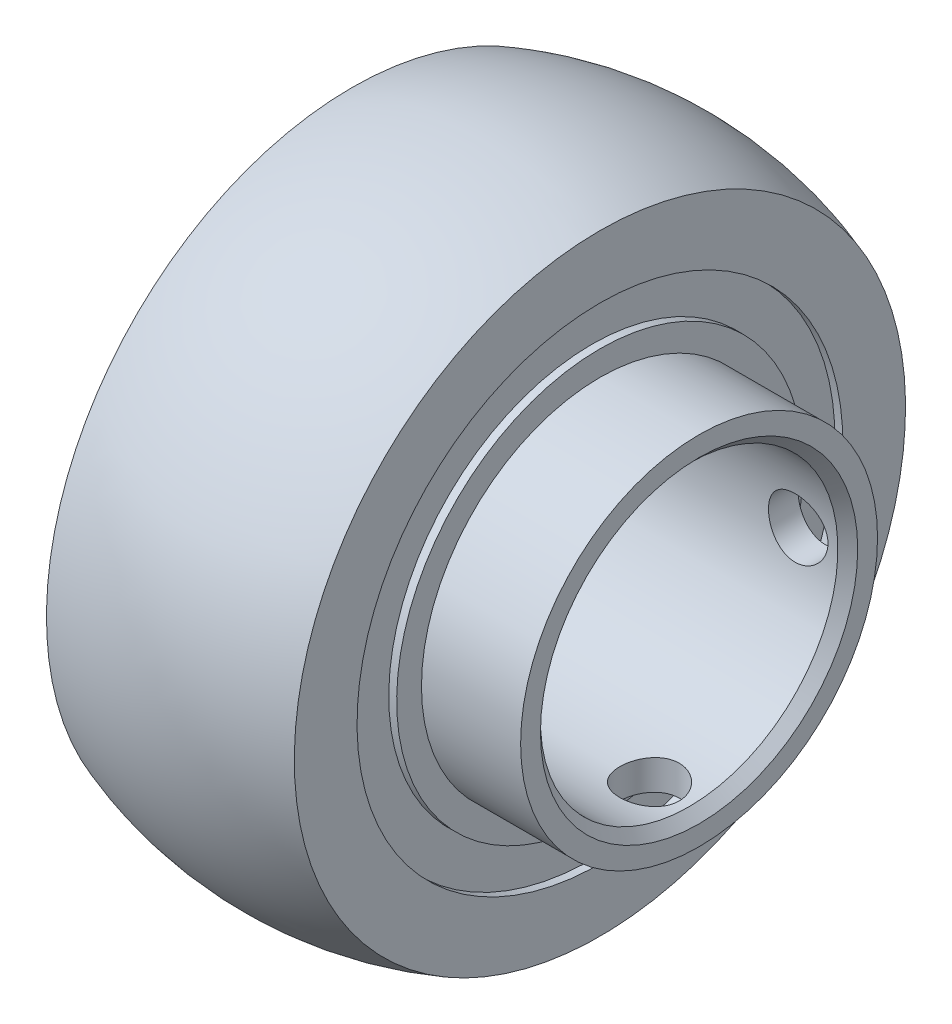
ISO-10303-21;
HEADER;
FILE_DESCRIPTION(('STEP AP214'),'2;1');
FILE_NAME('part.step','',(''),(''),'','','');
FILE_SCHEMA(('AUTOMOTIVE_DESIGN { 1 0 10303 214 1 1 1 1 }'));
ENDSEC;
DATA;
#1=APPLICATION_CONTEXT('core data for automotive mechanical design processes');
#2=APPLICATION_PROTOCOL_DEFINITION('international standard','automotive_design',2000,#1);
#3=PRODUCT_CONTEXT('',#1,'mechanical');
#4=PRODUCT('Part','Part','',(#3));
#5=PRODUCT_RELATED_PRODUCT_CATEGORY('part','',(#4));
#6=PRODUCT_DEFINITION_FORMATION('','',#4);
#7=PRODUCT_DEFINITION_CONTEXT('part definition',#1,'design');
#8=PRODUCT_DEFINITION('design','',#6,#7);
#9=PRODUCT_DEFINITION_SHAPE('','',#8);
#10=(LENGTH_UNIT() NAMED_UNIT(*) SI_UNIT(.MILLI.,.METRE.));
#11=(NAMED_UNIT(*) PLANE_ANGLE_UNIT() SI_UNIT($,.RADIAN.));
#12=(NAMED_UNIT(*) SI_UNIT($,.STERADIAN.) SOLID_ANGLE_UNIT());
#13=UNCERTAINTY_MEASURE_WITH_UNIT(LENGTH_MEASURE(1.E-05),#10,'distance_accuracy_value','');
#14=(GEOMETRIC_REPRESENTATION_CONTEXT(3) GLOBAL_UNCERTAINTY_ASSIGNED_CONTEXT((#13)) GLOBAL_UNIT_ASSIGNED_CONTEXT((#10,
#11,#12)) REPRESENTATION_CONTEXT('',''));
#15=CARTESIAN_POINT('',(0.,0.,0.));
#16=DIRECTION('',(0.,0.,1.));
#17=DIRECTION('',(1.,0.,0.));
#18=AXIS2_PLACEMENT_3D('',#15,#16,#17);
#19=CARTESIAN_POINT('',(13.,0.,0.));
#20=DIRECTION('',(1.,0.,0.));
#21=DIRECTION('',(0.,1.,0.));
#22=AXIS2_PLACEMENT_3D('',#19,#20,#21);
#23=CYLINDRICAL_SURFACE('',#22,18.);
#24=CARTESIAN_POINT('',(-17.5,0.,0.));
#25=DIRECTION('',(1.,0.,0.));
#26=DIRECTION('',(0.,1.,0.));
#27=AXIS2_PLACEMENT_3D('',#24,#25,#26);
#28=CIRCLE('',#27,18.);
#29=CARTESIAN_POINT('',(-17.5,18.,0.));
#30=VERTEX_POINT('',#29);
#31=EDGE_CURVE('E10',#30,#30,#28,.T.);
#32=ORIENTED_EDGE('',*,*,#31,.T.);
#33=EDGE_LOOP('',(#32));
#34=FACE_BOUND('',#33,.T.);
#35=CARTESIAN_POINT('',(-12.5,0.,0.));
#36=DIRECTION('',(1.,0.,0.));
#37=DIRECTION('',(0.,1.,0.));
#38=AXIS2_PLACEMENT_3D('',#35,#36,#37);
#39=CIRCLE('',#38,18.);
#40=CARTESIAN_POINT('',(-12.5,18.,0.));
#41=VERTEX_POINT('',#40);
#42=EDGE_CURVE('E78',#41,#41,#39,.T.);
#43=ORIENTED_EDGE('',*,*,#42,.F.);
#44=EDGE_LOOP('',(#43));
#45=FACE_BOUND('',#44,.T.);
#46=ADVANCED_FACE('F31',(#34,#45),#23,.T.);
#47=CARTESIAN_POINT('',(-17.5,18.,0.));
#48=DIRECTION('',(-1.,0.,0.));
#49=DIRECTION('',(0.,-1.,0.));
#50=AXIS2_PLACEMENT_3D('',#47,#48,#49);
#51=PLANE('',#50);
#52=CARTESIAN_POINT('',(-17.5,0.,0.));
#53=DIRECTION('',(1.,0.,0.));
#54=DIRECTION('',(0.,1.,0.));
#55=AXIS2_PLACEMENT_3D('',#52,#53,#54);
#56=CIRCLE('',#55,16.);
#57=CARTESIAN_POINT('',(-17.5,16.,0.));
#58=VERTEX_POINT('',#57);
#59=EDGE_CURVE('E42',#58,#58,#56,.T.);
#60=ORIENTED_EDGE('',*,*,#59,.T.);
#61=EDGE_LOOP('',(#60));
#62=FACE_BOUND('',#61,.T.);
#63=ORIENTED_EDGE('',*,*,#31,.F.);
#64=EDGE_LOOP('',(#63));
#65=FACE_BOUND('',#64,.T.);
#66=ADVANCED_FACE('F92',(#62,#65),#51,.T.);
#67=CARTESIAN_POINT('',(-17.5,0.,0.));
#68=DIRECTION('',(-1.,0.,0.));
#69=DIRECTION('',(0.,-1.,0.));
#70=AXIS2_PLACEMENT_3D('',#67,#68,#69);
#71=CONICAL_SURFACE('',#70,16.,0.785398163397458);
#72=CARTESIAN_POINT('',(-16.5,0.,0.));
#73=DIRECTION('',(1.,0.,0.));
#74=DIRECTION('',(0.,1.,0.));
#75=AXIS2_PLACEMENT_3D('',#72,#73,#74);
#76=CIRCLE('',#75,15.);
#77=CARTESIAN_POINT('',(-16.5,15.,0.));
#78=VERTEX_POINT('',#77);
#79=EDGE_CURVE('E47',#78,#78,#76,.T.);
#80=ORIENTED_EDGE('',*,*,#79,.T.);
#81=EDGE_LOOP('',(#80));
#82=FACE_BOUND('',#81,.T.);
#83=ORIENTED_EDGE('',*,*,#59,.F.);
#84=EDGE_LOOP('',(#83));
#85=FACE_BOUND('',#84,.T.);
#86=ADVANCED_FACE('F88',(#82,#85),#71,.F.);
#87=CARTESIAN_POINT('',(13.,0.,0.));
#88=DIRECTION('',(1.,0.,0.));
#89=DIRECTION('',(0.,1.,0.));
#90=AXIS2_PLACEMENT_3D('',#87,#88,#89);
#91=CYLINDRICAL_SURFACE('',#90,15.);
#92=CARTESIAN_POINT('',(17.5,-14.6969384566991,3.));
#93=CARTESIAN_POINT('',(17.6666931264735,-14.6969417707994,2.99999383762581));
#94=CARTESIAN_POINT('',(17.83346387,-14.6998052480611,2.98605951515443));
#95=CARTESIAN_POINT('',(18.1622875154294,-14.7109329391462,2.93073685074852));
#96=CARTESIAN_POINT('',(18.324336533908,-14.7192014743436,2.88932654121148));
#97=CARTESIAN_POINT('',(18.6389119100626,-14.7401662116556,2.78038734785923));
#98=CARTESIAN_POINT('',(18.7914475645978,-14.7528580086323,2.71288444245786));
#99=CARTESIAN_POINT('',(19.0830245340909,-14.7812339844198,2.55374732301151));
#100=CARTESIAN_POINT('',(19.2220666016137,-14.7969179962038,2.46211445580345));
#101=CARTESIAN_POINT('',(19.4846830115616,-14.8297589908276,2.2559372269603));
#102=CARTESIAN_POINT('',(19.6080387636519,-14.8469321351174,2.14111696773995));
#103=CARTESIAN_POINT('',(19.833872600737,-14.880674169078,1.89242036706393));
#104=CARTESIAN_POINT('',(19.9363492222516,-14.8972430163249,1.75854269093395));
#105=CARTESIAN_POINT('',(20.1183640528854,-14.9280838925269,1.47408406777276));
#106=CARTESIAN_POINT('',(20.1976945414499,-14.9423346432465,1.32336770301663));
#107=CARTESIAN_POINT('',(20.3298248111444,-14.9667521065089,1.01041245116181));
#108=CARTESIAN_POINT('',(20.382627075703,-14.9769192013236,0.848174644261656));
#109=CARTESIAN_POINT('',(20.4595215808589,-14.9919096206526,0.519050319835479));
#110=CARTESIAN_POINT('',(20.483982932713,-14.9968015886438,0.352253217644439));
#111=CARTESIAN_POINT('',(20.504652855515,-15.0009276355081,0.0168557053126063));
#112=CARTESIAN_POINT('',(20.5008641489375,-15.0001622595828,-0.151744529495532));
#113=CARTESIAN_POINT('',(20.4654214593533,-14.9931130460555,-0.483426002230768));
#114=CARTESIAN_POINT('',(20.4341650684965,-14.9869079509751,-0.646551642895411));
#115=CARTESIAN_POINT('',(20.3453049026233,-14.9697653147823,-0.965194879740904));
#116=CARTESIAN_POINT('',(20.2877000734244,-14.9588275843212,-1.12071217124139));
#117=CARTESIAN_POINT('',(20.1474098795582,-14.9333188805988,-1.42085838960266));
#118=CARTESIAN_POINT('',(20.0645687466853,-14.9187254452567,-1.5654125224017));
#119=CARTESIAN_POINT('',(19.8762727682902,-14.8875140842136,-1.83871513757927));
#120=CARTESIAN_POINT('',(19.7708153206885,-14.8708959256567,-1.967461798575));
#121=CARTESIAN_POINT('',(19.5380991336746,-14.8371289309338,-2.20785429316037));
#122=CARTESIAN_POINT('',(19.4104924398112,-14.8199758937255,-2.31916294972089));
#123=CARTESIAN_POINT('',(19.1382506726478,-14.7873471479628,-2.51885547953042));
#124=CARTESIAN_POINT('',(18.9936152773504,-14.7718714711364,-2.60723891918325));
#125=CARTESIAN_POINT('',(18.6909375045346,-14.7443414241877,-2.75868844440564));
#126=CARTESIAN_POINT('',(18.532867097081,-14.7322944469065,-2.82169994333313));
#127=CARTESIAN_POINT('',(18.208086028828,-14.7130942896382,-2.92017102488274));
#128=CARTESIAN_POINT('',(18.0413764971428,-14.7059404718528,-2.95563419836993));
#129=CARTESIAN_POINT('',(17.7071054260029,-14.6974643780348,-2.99749801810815));
#130=CARTESIAN_POINT('',(17.539607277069,-14.6960444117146,-3.00438557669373));
#131=CARTESIAN_POINT('',(17.205855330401,-14.6989345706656,-2.99021288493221));
#132=CARTESIAN_POINT('',(17.0396014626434,-14.7032443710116,-2.96915421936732));
#133=CARTESIAN_POINT('',(16.7146940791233,-14.7170169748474,-2.90010662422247));
#134=CARTESIAN_POINT('',(16.5559829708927,-14.7264299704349,-2.85237786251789));
#135=CARTESIAN_POINT('',(16.2488101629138,-14.7493046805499,-2.73162310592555));
#136=CARTESIAN_POINT('',(16.1003493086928,-14.7627667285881,-2.65859502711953));
#137=CARTESIAN_POINT('',(15.8157606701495,-14.7924421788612,-2.48821242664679));
#138=CARTESIAN_POINT('',(15.6798188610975,-14.8086891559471,-2.39055323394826));
#139=CARTESIAN_POINT('',(15.4260750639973,-14.8420117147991,-2.17408671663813));
#140=CARTESIAN_POINT('',(15.3082749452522,-14.8590873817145,-2.05527721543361));
#141=CARTESIAN_POINT('',(15.0923123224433,-14.8924603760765,-1.79769682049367));
#142=CARTESIAN_POINT('',(14.99447903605,-14.9087417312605,-1.65864749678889));
#143=CARTESIAN_POINT('',(14.8235623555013,-14.9384138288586,-1.36580368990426));
#144=CARTESIAN_POINT('',(14.7504779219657,-14.9518046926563,-1.21200982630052));
#145=CARTESIAN_POINT('',(14.6316133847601,-14.974118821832,-0.894908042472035));
#146=CARTESIAN_POINT('',(14.5856784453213,-14.9830673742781,-0.731660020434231));
#147=CARTESIAN_POINT('',(14.5219262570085,-14.9955970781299,-0.399568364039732));
#148=CARTESIAN_POINT('',(14.504105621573,-14.9991788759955,-0.230725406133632));
#149=CARTESIAN_POINT('',(14.4972190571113,-15.0005562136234,0.104618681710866));
#150=CARTESIAN_POINT('',(14.5076581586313,-14.9984513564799,0.271109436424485));
#151=CARTESIAN_POINT('',(14.5559018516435,-14.9889013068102,0.599913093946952));
#152=CARTESIAN_POINT('',(14.5937060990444,-14.9814561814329,0.762226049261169));
#153=CARTESIAN_POINT('',(14.6953869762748,-14.9620649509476,1.0777582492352));
#154=CARTESIAN_POINT('',(14.7592041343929,-14.9501291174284,1.23099732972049));
#155=CARTESIAN_POINT('',(14.9110367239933,-14.9230416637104,1.52466366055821));
#156=CARTESIAN_POINT('',(14.9990540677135,-14.9078897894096,1.66508989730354));
#157=CARTESIAN_POINT('',(15.1984581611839,-14.8757279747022,1.93159167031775));
#158=CARTESIAN_POINT('',(15.3101990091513,-14.858692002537,2.05739914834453));
#159=CARTESIAN_POINT('',(15.5531507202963,-14.8248366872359,2.28864785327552));
#160=CARTESIAN_POINT('',(15.6843661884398,-14.8080173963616,2.39408424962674));
#161=CARTESIAN_POINT('',(15.9642379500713,-14.7763002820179,2.58267665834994));
#162=CARTESIAN_POINT('',(16.1130668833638,-14.7614251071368,2.66558044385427));
#163=CARTESIAN_POINT('',(16.4227983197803,-14.7355571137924,2.80507214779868));
#164=CARTESIAN_POINT('',(16.5836897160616,-14.7245607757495,2.86168393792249));
#165=CARTESIAN_POINT('',(16.8707873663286,-14.7098904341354,2.93600741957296));
#166=CARTESIAN_POINT('',(16.9953562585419,-14.7050635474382,2.95996169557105));
#167=CARTESIAN_POINT('',(17.2466018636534,-14.6985863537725,2.99196005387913));
#168=CARTESIAN_POINT('',(17.3732785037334,-14.6969359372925,3.00000468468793));
#169=CARTESIAN_POINT('',(17.5,-14.6969384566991,3.));
#170=B_SPLINE_CURVE_WITH_KNOTS('',3,(#92,#93,#94,#95,#96,#97,#98,#99,#100,#101,#102,#103,#104,
#105,#106,#107,#108,#109,#110,#111,#112,#113,#114,#115,#116,#117,#118,#119,#120,#121,#122,#123,
#124,#125,#126,#127,#128,#129,#130,#131,#132,#133,#134,#135,#136,#137,#138,#139,#140,#141,#142,
#143,#144,#145,#146,#147,#148,#149,#150,#151,#152,#153,#154,#155,#156,#157,#158,#159,#160,#161,
#162,#163,#164,#165,#166,#167,#168,#169),.UNSPECIFIED.,.T.,.F.,(4,2,2,2,2,2,2,2,2,2,2,2,2,2,2,2,
2,2,2,2,2,2,2,2,2,2,2,2,2,2,2,2,2,2,2,2,2,2,4),(0.,0.499615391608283,0.999630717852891,
1.49914949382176,1.9986403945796,2.5044675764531,3.01033020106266,3.52060201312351,
4.03082604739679,4.53432746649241,5.03778036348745,5.53406368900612,6.0303668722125,
6.52979772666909,7.02928607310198,7.53748040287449,8.04568434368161,8.5549758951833,
9.06420105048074,9.5647127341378,10.0651960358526,10.5608802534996,11.0566053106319,
11.5587917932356,12.0610299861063,12.5709780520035,13.0809046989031,13.5878944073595,
14.0948230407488,14.5929305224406,15.0910317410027,15.5880005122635,16.0850085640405,
16.5900345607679,17.0951801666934,17.6057669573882,18.1158892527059,18.4957141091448,
18.8755258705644),.UNSPECIFIED.);
#171=CARTESIAN_POINT('',(17.5,-14.6969384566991,3.));
#172=VERTEX_POINT('',#171);
#173=EDGE_CURVE('E56',#172,#172,#170,.T.);
#174=ORIENTED_EDGE('',*,*,#173,.F.);
#175=EDGE_LOOP('',(#174));
#176=FACE_BOUND('',#175,.T.);
#177=CARTESIAN_POINT('',(20.5,0.,-15.));
#178=CARTESIAN_POINT('',(20.499993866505,0.1667307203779,-14.9999969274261));
#179=CARTESIAN_POINT('',(20.4860534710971,0.333538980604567,-14.9971915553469));
#180=CARTESIAN_POINT('',(20.4307044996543,0.662440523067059,-14.9862709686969));
#181=CARTESIAN_POINT('',(20.3892741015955,0.824529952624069,-14.9781515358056));
#182=CARTESIAN_POINT('',(20.2802761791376,1.13919091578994,-14.9575094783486));
#183=CARTESIAN_POINT('',(20.212733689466,1.29177140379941,-14.9449910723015));
#184=CARTESIAN_POINT('',(20.0535032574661,1.58342396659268,-14.9169119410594));
#185=CARTESIAN_POINT('',(19.9618167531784,1.72249684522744,-14.9013513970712));
#186=CARTESIAN_POINT('',(19.7555845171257,1.9850804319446,-14.8686649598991));
#187=CARTESIAN_POINT('',(19.6407749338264,2.10838185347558,-14.8515223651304));
#188=CARTESIAN_POINT('',(19.3921227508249,2.33411026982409,-14.8177254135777));
#189=CARTESIAN_POINT('',(19.2582786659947,2.43653563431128,-14.8010710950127));
#190=CARTESIAN_POINT('',(18.9738514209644,2.61849526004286,-14.7699732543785));
#191=CARTESIAN_POINT('',(18.8231270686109,2.6978128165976,-14.7555512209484));
#192=CARTESIAN_POINT('',(18.5101545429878,2.82991699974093,-14.7307880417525));
#193=CARTESIAN_POINT('',(18.347907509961,2.88270624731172,-14.7204464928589));
#194=CARTESIAN_POINT('',(18.0187469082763,2.95957589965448,-14.7051841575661));
#195=CARTESIAN_POINT('',(17.8519223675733,2.98402349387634,-14.7001941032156));
#196=CARTESIAN_POINT('',(17.516470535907,3.00465638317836,-14.6959912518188));
#197=CARTESIAN_POINT('',(17.3478434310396,3.0008445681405,-14.6967778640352));
#198=CARTESIAN_POINT('',(17.016259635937,2.96536371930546,-14.7039765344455));
#199=CARTESIAN_POINT('',(16.8532557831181,2.93411562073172,-14.7103035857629));
#200=CARTESIAN_POINT('',(16.534851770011,2.84531365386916,-14.7277363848));
#201=CARTESIAN_POINT('',(16.379451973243,2.78775852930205,-14.7388423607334));
#202=CARTESIAN_POINT('',(16.0794542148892,2.64757435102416,-14.7646685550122));
#203=CARTESIAN_POINT('',(15.9349363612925,2.56477845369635,-14.7794126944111));
#204=CARTESIAN_POINT('',(15.6616874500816,2.37658072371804,-14.8108385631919));
#205=CARTESIAN_POINT('',(15.5329582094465,2.27117629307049,-14.827520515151));
#206=CARTESIAN_POINT('',(15.2925117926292,2.03849980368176,-14.8613106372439));
#207=CARTESIAN_POINT('',(15.1811422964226,1.91086848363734,-14.8784210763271));
#208=CARTESIAN_POINT('',(14.9813384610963,1.63855507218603,-14.9108654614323));
#209=CARTESIAN_POINT('',(14.8929044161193,1.49387276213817,-14.9261993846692));
#210=CARTESIAN_POINT('',(14.7414174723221,1.19117816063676,-14.9534007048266));
#211=CARTESIAN_POINT('',(14.6784043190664,1.0331454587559,-14.9652626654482));
#212=CARTESIAN_POINT('',(14.5799185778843,0.708446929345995,-14.9841422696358));
#213=CARTESIAN_POINT('',(14.5444426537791,0.541782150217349,-14.9911605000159));
#214=CARTESIAN_POINT('',(14.5025306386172,0.207538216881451,-14.999480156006));
#215=CARTESIAN_POINT('',(14.4956187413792,0.0400209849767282,-15.0008752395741));
#216=CARTESIAN_POINT('',(14.5097495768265,-0.293774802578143,-14.9980515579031));
#217=CARTESIAN_POINT('',(14.5307907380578,-0.460053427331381,-14.9938331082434));
#218=CARTESIAN_POINT('',(14.5998351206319,-0.785116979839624,-14.9803149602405));
#219=CARTESIAN_POINT('',(14.6475942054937,-0.943955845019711,-14.9710612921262));
#220=CARTESIAN_POINT('',(14.7684519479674,-1.251370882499,-14.948506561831));
#221=CARTESIAN_POINT('',(14.8415525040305,-1.39994628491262,-14.9352051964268));
#222=CARTESIAN_POINT('',(15.0120474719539,-1.68462352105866,-14.9057973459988));
#223=CARTESIAN_POINT('',(15.1097283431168,-1.82055038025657,-14.8896585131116));
#224=CARTESIAN_POINT('',(15.3262275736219,-2.07425405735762,-14.8564420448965));
#225=CARTESIAN_POINT('',(15.4450481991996,-2.19202892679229,-14.8393643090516));
#226=CARTESIAN_POINT('',(15.7026200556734,-2.40792177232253,-14.805879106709));
#227=CARTESIAN_POINT('',(15.841647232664,-2.50571310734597,-14.7894858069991));
#228=CARTESIAN_POINT('',(16.13443408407,-2.67655626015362,-14.7595257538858));
#229=CARTESIAN_POINT('',(16.2881931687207,-2.74960906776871,-14.7459588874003));
#230=CARTESIAN_POINT('',(16.6053047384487,-2.86845552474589,-14.7233022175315));
#231=CARTESIAN_POINT('',(16.768602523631,-2.91439049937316,-14.7141892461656));
#232=CARTESIAN_POINT('',(17.1008003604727,-2.97812595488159,-14.7014231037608));
#233=CARTESIAN_POINT('',(17.2696996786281,-2.99593010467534,-14.6977692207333));
#234=CARTESIAN_POINT('',(17.605026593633,-3.00276273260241,-14.6963744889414));
#235=CARTESIAN_POINT('',(17.771443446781,-2.99230736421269,-14.698527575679));
#236=CARTESIAN_POINT('',(18.1000949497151,-2.94405691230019,-14.7082672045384));
#237=CARTESIAN_POINT('',(18.2623296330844,-2.9062620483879,-14.7158537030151));
#238=CARTESIAN_POINT('',(18.5776831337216,-2.80463570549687,-14.7355579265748));
#239=CARTESIAN_POINT('',(18.7308230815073,-2.74086752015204,-14.7476646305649));
#240=CARTESIAN_POINT('',(19.0243111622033,-2.58916393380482,-14.7750514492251));
#241=CARTESIAN_POINT('',(19.1646582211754,-2.50122650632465,-14.7903318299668));
#242=CARTESIAN_POINT('',(19.431146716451,-2.30191774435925,-14.8226688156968));
#243=CARTESIAN_POINT('',(19.5570062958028,-2.19017366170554,-14.839751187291));
#244=CARTESIAN_POINT('',(19.7883586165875,-1.94719310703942,-14.8735824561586));
#245=CARTESIAN_POINT('',(19.8938466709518,-1.81595216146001,-14.8903312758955));
#246=CARTESIAN_POINT('',(20.0825039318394,-1.53605288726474,-14.9218149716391));
#247=CARTESIAN_POINT('',(20.1654280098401,-1.38722665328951,-14.9365269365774));
#248=CARTESIAN_POINT('',(20.3049583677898,-1.0774990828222,-14.96205375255));
#249=CARTESIAN_POINT('',(20.3615883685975,-0.91660878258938,-14.9728721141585));
#250=CARTESIAN_POINT('',(20.4359558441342,-0.629464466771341,-14.9872911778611));
#251=CARTESIAN_POINT('',(20.4599295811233,-0.504844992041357,-14.9920290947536));
#252=CARTESIAN_POINT('',(20.4919537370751,-0.253498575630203,-14.9983846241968));
#253=CARTESIAN_POINT('',(20.5000046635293,-0.126771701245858,-15.0000023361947));
#254=CARTESIAN_POINT('',(20.5,0.,-15.));
#255=B_SPLINE_CURVE_WITH_KNOTS('',3,(#177,#178,#179,#180,#181,#182,#183,#184,#185,#186,#187,
#188,#189,#190,#191,#192,#193,#194,#195,#196,#197,#198,#199,#200,#201,#202,#203,#204,#205,#206,
#207,#208,#209,#210,#211,#212,#213,#214,#215,#216,#217,#218,#219,#220,#221,#222,#223,#224,#225,
#226,#227,#228,#229,#230,#231,#232,#233,#234,#235,#236,#237,#238,#239,#240,#241,#242,#243,#244,
#245,#246,#247,#248,#249,#250,#251,#252,#253,#254),.UNSPECIFIED.,.T.,.F.,(4,2,2,2,2,2,2,2,2,2,2,
2,2,2,2,2,2,2,2,2,2,2,2,2,2,2,2,2,2,2,2,2,2,2,2,2,2,2,4),(0.,0.499728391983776,
0.999853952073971,1.49950120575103,1.99911870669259,2.50479801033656,3.0105167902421,
3.52083585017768,4.03110448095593,4.53468555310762,5.03821512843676,5.53415181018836,
6.0301121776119,6.52942470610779,7.02879464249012,7.53714757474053,8.04550702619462,
8.55465824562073,9.06374777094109,9.56432207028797,10.064868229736,10.5609136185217,
11.0569961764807,11.5591519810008,12.0613616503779,12.5712188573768,13.081055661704,
13.5882114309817,14.0953010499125,14.5931916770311,15.0910783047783,15.5877588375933,
16.084481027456,16.5896422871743,17.0949196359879,17.6054849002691,18.1155886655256,
18.4955632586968,18.8755257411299),.UNSPECIFIED.);
#256=CARTESIAN_POINT('',(20.5,0.,-15.));
#257=VERTEX_POINT('',#256);
#258=EDGE_CURVE('E55',#257,#257,#255,.T.);
#259=ORIENTED_EDGE('',*,*,#258,.F.);
#260=EDGE_LOOP('',(#259));
#261=FACE_BOUND('',#260,.T.);
#262=CARTESIAN_POINT('',(21.5,0.,0.));
#263=DIRECTION('',(1.,0.,0.));
#264=DIRECTION('',(0.,1.,0.));
#265=AXIS2_PLACEMENT_3D('',#262,#263,#264);
#266=CIRCLE('',#265,15.);
#267=CARTESIAN_POINT('',(21.5,15.,0.));
#268=VERTEX_POINT('',#267);
#269=EDGE_CURVE('E149',#268,#268,#266,.T.);
#270=ORIENTED_EDGE('',*,*,#269,.T.);
#271=EDGE_LOOP('',(#270));
#272=FACE_BOUND('',#271,.T.);
#273=ORIENTED_EDGE('',*,*,#79,.F.);
#274=EDGE_LOOP('',(#273));
#275=FACE_BOUND('',#274,.T.);
#276=ADVANCED_FACE('F82',(#176,#261,#272,#275),#91,.F.);
#277=CARTESIAN_POINT('',(21.5,0.,0.));
#278=DIRECTION('',(1.,0.,0.));
#279=DIRECTION('',(0.,1.,0.));
#280=AXIS2_PLACEMENT_3D('',#277,#278,#279);
#281=CONICAL_SURFACE('',#280,15.,0.785398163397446);
#282=CARTESIAN_POINT('',(22.5,0.,0.));
#283=DIRECTION('',(1.,0.,0.));
#284=DIRECTION('',(0.,1.,0.));
#285=AXIS2_PLACEMENT_3D('',#282,#283,#284);
#286=CIRCLE('',#285,16.);
#287=CARTESIAN_POINT('',(22.5,16.,0.));
#288=VERTEX_POINT('',#287);
#289=EDGE_CURVE('E146',#288,#288,#286,.T.);
#290=ORIENTED_EDGE('',*,*,#289,.T.);
#291=EDGE_LOOP('',(#290));
#292=FACE_BOUND('',#291,.T.);
#293=ORIENTED_EDGE('',*,*,#269,.F.);
#294=EDGE_LOOP('',(#293));
#295=FACE_BOUND('',#294,.T.);
#296=ADVANCED_FACE('F87',(#292,#295),#281,.F.);
#297=CARTESIAN_POINT('',(22.5,16.,0.));
#298=DIRECTION('',(1.,0.,0.));
#299=DIRECTION('',(0.,1.,0.));
#300=AXIS2_PLACEMENT_3D('',#297,#298,#299);
#301=PLANE('',#300);
#302=CARTESIAN_POINT('',(22.5,0.,0.));
#303=DIRECTION('',(1.,0.,0.));
#304=DIRECTION('',(0.,1.,0.));
#305=AXIS2_PLACEMENT_3D('',#302,#303,#304);
#306=CIRCLE('',#305,18.);
#307=CARTESIAN_POINT('',(22.5,18.,0.));
#308=VERTEX_POINT('',#307);
#309=EDGE_CURVE('E143',#308,#308,#306,.T.);
#310=ORIENTED_EDGE('',*,*,#309,.T.);
#311=EDGE_LOOP('',(#310));
#312=FACE_BOUND('',#311,.T.);
#313=ORIENTED_EDGE('',*,*,#289,.F.);
#314=EDGE_LOOP('',(#313));
#315=FACE_BOUND('',#314,.T.);
#316=ADVANCED_FACE('F158',(#312,#315),#301,.T.);
#317=CARTESIAN_POINT('',(13.,0.,0.));
#318=DIRECTION('',(1.,0.,0.));
#319=DIRECTION('',(0.,1.,0.));
#320=AXIS2_PLACEMENT_3D('',#317,#318,#319);
#321=CYLINDRICAL_SURFACE('',#320,18.);
#322=CARTESIAN_POINT('',(17.5,-17.7482393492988,3.));
#323=CARTESIAN_POINT('',(17.3327491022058,-17.7482423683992,2.99999327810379));
#324=CARTESIAN_POINT('',(17.1654068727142,-17.7506291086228,2.98596620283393));
#325=CARTESIAN_POINT('',(16.8354177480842,-17.7599094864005,2.93025291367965));
#326=CARTESIAN_POINT('',(16.6727753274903,-17.7668072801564,2.88854119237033));
#327=CARTESIAN_POINT('',(16.3570092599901,-17.7843073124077,2.77875545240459));
#328=CARTESIAN_POINT('',(16.2038777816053,-17.7949064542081,2.71070346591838));
#329=CARTESIAN_POINT('',(15.9112228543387,-17.8186112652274,2.55022379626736));
#330=CARTESIAN_POINT('',(15.7716978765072,-17.8317166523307,2.45779885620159));
#331=CARTESIAN_POINT('',(15.5088245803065,-17.8591016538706,2.25022503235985));
#332=CARTESIAN_POINT('',(15.3856298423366,-17.8733906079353,2.1348828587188));
#333=CARTESIAN_POINT('',(15.1602480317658,-17.901449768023,1.88516640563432));
#334=CARTESIAN_POINT('',(15.0580622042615,-17.9152199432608,1.75079099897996));
#335=CARTESIAN_POINT('',(14.8770225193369,-17.9407888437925,1.46582744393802));
#336=CARTESIAN_POINT('',(14.7983115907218,-17.9525753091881,1.31514729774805));
#337=CARTESIAN_POINT('',(14.6673747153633,-17.9727448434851,1.00247474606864));
#338=CARTESIAN_POINT('',(14.6151470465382,-17.9811281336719,0.840483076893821));
#339=CARTESIAN_POINT('',(14.5391289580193,-17.9934808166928,0.511372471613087));
#340=CARTESIAN_POINT('',(14.5150805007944,-17.9974902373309,0.344314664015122));
#341=CARTESIAN_POINT('',(14.4953010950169,-18.0007809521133,0.00849034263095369));
#342=CARTESIAN_POINT('',(14.4995682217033,-18.0000625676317,-0.160276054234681));
#343=CARTESIAN_POINT('',(14.5360976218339,-17.9940103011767,-0.492962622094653));
#344=CARTESIAN_POINT('',(14.568082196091,-17.9887222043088,-0.656914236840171));
#345=CARTESIAN_POINT('',(14.6587012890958,-17.9741757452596,-0.977090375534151));
#346=CARTESIAN_POINT('',(14.7173366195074,-17.9649172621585,-1.13331466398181));
#347=CARTESIAN_POINT('',(14.8598687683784,-17.9433923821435,-1.43442737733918));
#348=CARTESIAN_POINT('',(14.9438800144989,-17.9311124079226,-1.57926062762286));
#349=CARTESIAN_POINT('',(15.1346953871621,-17.904908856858,-1.85287863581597));
#350=CARTESIAN_POINT('',(15.241501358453,-17.8909851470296,-1.98166209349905));
#351=CARTESIAN_POINT('',(15.4764145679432,-17.8628432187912,-2.221165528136));
#352=CARTESIAN_POINT('',(15.6047645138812,-17.8486234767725,-2.33164740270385));
#353=CARTESIAN_POINT('',(15.878304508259,-17.8216555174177,-2.52954550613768));
#354=CARTESIAN_POINT('',(16.0234947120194,-17.8089073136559,-2.6169615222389));
#355=CARTESIAN_POINT('',(16.326869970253,-17.7863250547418,-2.76629332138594));
#356=CARTESIAN_POINT('',(16.4850693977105,-17.7764942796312,-2.82818043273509));
#357=CARTESIAN_POINT('',(16.8098188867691,-17.7609142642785,-2.92443584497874));
#358=CARTESIAN_POINT('',(16.9763682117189,-17.7551646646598,-2.95880656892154));
#359=CARTESIAN_POINT('',(17.3109593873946,-17.7484675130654,-2.99871826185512));
#360=CARTESIAN_POINT('',(17.4789596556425,-17.747463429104,-3.00459864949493));
#361=CARTESIAN_POINT('',(17.813544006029,-17.7502204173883,-2.98826724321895));
#362=CARTESIAN_POINT('',(17.9801281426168,-17.7539813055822,-2.96605653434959));
#363=CARTESIAN_POINT('',(18.306073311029,-17.7657922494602,-2.89446280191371));
#364=CARTESIAN_POINT('',(18.4654733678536,-17.7738150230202,-2.84525254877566));
#365=CARTESIAN_POINT('',(18.7737641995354,-17.793222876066,-2.72123782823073));
#366=CARTESIAN_POINT('',(18.9226543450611,-17.8046081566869,-2.64643182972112));
#367=CARTESIAN_POINT('',(19.2072095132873,-17.8295895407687,-2.47254800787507));
#368=CARTESIAN_POINT('',(19.3427398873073,-17.8432050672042,-2.37325267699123));
#369=CARTESIAN_POINT('',(19.595336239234,-17.8710560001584,-2.15350735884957));
#370=CARTESIAN_POINT('',(19.7124009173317,-17.885291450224,-2.03305588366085));
#371=CARTESIAN_POINT('',(19.9259822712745,-17.9129570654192,-1.77291368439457));
#372=CARTESIAN_POINT('',(20.0222725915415,-17.9263773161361,-1.63303590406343));
#373=CARTESIAN_POINT('',(20.1899863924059,-17.9507413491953,-1.33889213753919));
#374=CARTESIAN_POINT('',(20.2614106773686,-17.9616852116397,-1.18462661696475));
#375=CARTESIAN_POINT('',(20.3770127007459,-17.979820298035,-0.866758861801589));
#376=CARTESIAN_POINT('',(20.4213088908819,-17.9870278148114,-0.70320067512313));
#377=CARTESIAN_POINT('',(20.4817787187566,-17.9969469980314,-0.37083688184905));
#378=CARTESIAN_POINT('',(20.4979546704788,-17.9996590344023,-0.20203170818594));
#379=CARTESIAN_POINT('',(20.5016582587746,-18.0002764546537,0.133849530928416));
#380=CARTESIAN_POINT('',(20.4895303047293,-17.9982396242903,0.300921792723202));
#381=CARTESIAN_POINT('',(20.4377152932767,-17.989706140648,0.630614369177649));
#382=CARTESIAN_POINT('',(20.3980283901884,-17.9832095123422,0.793234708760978));
#383=CARTESIAN_POINT('',(20.2923542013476,-17.9664838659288,1.10927573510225));
#384=CARTESIAN_POINT('',(20.2263961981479,-17.9562590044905,1.26270644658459));
#385=CARTESIAN_POINT('',(20.0700904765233,-17.9331930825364,1.5563765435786));
#386=CARTESIAN_POINT('',(19.9797416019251,-17.920351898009,1.69661530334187));
#387=CARTESIAN_POINT('',(19.7759978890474,-17.8932915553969,1.96165553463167));
#388=CARTESIAN_POINT('',(19.6623508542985,-17.8790582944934,2.08626171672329));
#389=CARTESIAN_POINT('',(19.4157660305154,-17.8509156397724,2.31475665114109));
#390=CARTESIAN_POINT('',(19.282823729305,-17.8370063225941,2.41864054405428));
#391=CARTESIAN_POINT('',(19.0003056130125,-17.8109801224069,2.60341712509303));
#392=CARTESIAN_POINT('',(18.8506187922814,-17.7988766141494,2.68414198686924));
#393=CARTESIAN_POINT('',(18.5396689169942,-17.7779905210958,2.81917744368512));
#394=CARTESIAN_POINT('',(18.3784176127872,-17.7692046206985,2.87351442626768));
#395=CARTESIAN_POINT('',(18.0971154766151,-17.7578969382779,2.9424312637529));
#396=CARTESIAN_POINT('',(17.9787678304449,-17.7542954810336,2.96398490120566));
#397=CARTESIAN_POINT('',(17.7402958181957,-17.7494656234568,2.99277155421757));
#398=CARTESIAN_POINT('',(17.620171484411,-17.7482371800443,3.00000482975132));
#399=CARTESIAN_POINT('',(17.5,-17.7482393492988,3.));
#400=B_SPLINE_CURVE_WITH_KNOTS('',3,(#322,#323,#324,#325,#326,#327,#328,#329,#330,#331,#332,
#333,#334,#335,#336,#337,#338,#339,#340,#341,#342,#343,#344,#345,#346,#347,#348,#349,#350,#351,
#352,#353,#354,#355,#356,#357,#358,#359,#360,#361,#362,#363,#364,#365,#366,#367,#368,#369,#370,
#371,#372,#373,#374,#375,#376,#377,#378,#379,#380,#381,#382,#383,#384,#385,#386,#387,#388,#389,
#390,#391,#392,#393,#394,#395,#396,#397,#398,#399),.UNSPECIFIED.,.T.,.F.,(4,2,2,2,2,2,2,2,2,2,2,
2,2,2,2,2,2,2,2,2,2,2,2,2,2,2,2,2,2,2,2,2,2,2,2,2,2,2,4),(0.,0.501313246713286,1.00308902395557,
1.50444599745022,2.00574656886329,2.51146990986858,3.01722321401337,3.52599576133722,
4.03473522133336,4.53877880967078,5.0427881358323,5.54180545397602,6.04083797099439,
6.5421552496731,7.04351311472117,7.55095348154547,8.05839852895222,8.56641194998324,
9.07438063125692,9.57628250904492,10.0781650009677,10.5768727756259,11.0756103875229,
11.5789481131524,12.0823212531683,12.5909293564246,13.0995210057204,13.6058758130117,
14.1121889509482,14.612373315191,15.1125548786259,15.6121804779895,16.111829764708,
16.617203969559,17.1226965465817,17.6317647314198,18.1403228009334,18.5005280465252,
18.8607267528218),.UNSPECIFIED.);
#401=CARTESIAN_POINT('',(17.5,-17.7482393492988,3.));
#402=VERTEX_POINT('',#401);
#403=EDGE_CURVE('E34',#402,#402,#400,.T.);
#404=ORIENTED_EDGE('',*,*,#403,.F.);
#405=EDGE_LOOP('',(#404));
#406=FACE_BOUND('',#405,.T.);
#407=CARTESIAN_POINT('',(20.5,0.,-18.));
#408=CARTESIAN_POINT('',(20.4999932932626,-0.167269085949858,-17.9999971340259));
#409=CARTESIAN_POINT('',(20.4859632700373,-0.334629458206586,-17.9976441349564));
#410=CARTESIAN_POINT('',(20.4302372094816,-0.664656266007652,-17.9884841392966));
#411=CARTESIAN_POINT('',(20.3885157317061,-0.827318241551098,-17.9816730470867));
#412=CARTESIAN_POINT('',(20.2787014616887,-1.14312569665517,-17.9643608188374));
#413=CARTESIAN_POINT('',(20.2106302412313,-1.29627884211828,-17.9538627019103));
#414=CARTESIAN_POINT('',(20.0501052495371,-1.58897021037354,-17.9303307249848));
#415=CARTESIAN_POINT('',(19.9576542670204,-1.72850998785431,-17.9172971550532));
#416=CARTESIAN_POINT('',(19.7500538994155,-1.99136713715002,-17.8899998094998));
#417=CARTESIAN_POINT('',(19.6347170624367,-2.11453548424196,-17.8757264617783));
#418=CARTESIAN_POINT('',(19.3850224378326,-2.33986619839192,-17.8476315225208));
#419=CARTESIAN_POINT('',(19.2506634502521,-2.44202723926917,-17.833809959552));
#420=CARTESIAN_POINT('',(18.9657148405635,-2.62304055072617,-17.8080907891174));
#421=CARTESIAN_POINT('',(18.8150303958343,-2.70174546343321,-17.7962055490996));
#422=CARTESIAN_POINT('',(18.5023485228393,-2.83267003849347,-17.7758374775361));
#423=CARTESIAN_POINT('',(18.3403518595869,-2.88489148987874,-17.7673544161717));
#424=CARTESIAN_POINT('',(18.0112236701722,-2.96089725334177,-17.7548464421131));
#425=CARTESIAN_POINT('',(17.8441531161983,-2.98493883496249,-17.7507812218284));
#426=CARTESIAN_POINT('',(17.5083036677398,-3.00470007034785,-17.7474472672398));
#427=CARTESIAN_POINT('',(17.3395248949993,-3.0004217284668,-17.7481781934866));
#428=CARTESIAN_POINT('',(17.0068865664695,-2.96387411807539,-17.7543171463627));
#429=CARTESIAN_POINT('',(16.8429942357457,-2.93189385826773,-17.759676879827));
#430=CARTESIAN_POINT('',(16.5229344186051,-2.84130376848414,-17.7743939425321));
#431=CARTESIAN_POINT('',(16.3667671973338,-2.78269302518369,-17.7837514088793));
#432=CARTESIAN_POINT('',(16.0657254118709,-2.6402126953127,-17.8054617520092));
#433=CARTESIAN_POINT('',(15.9209087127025,-2.55622309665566,-17.8178288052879));
#434=CARTESIAN_POINT('',(15.6473147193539,-2.36545442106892,-17.8441550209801));
#435=CARTESIAN_POINT('',(15.5185387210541,-2.25867350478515,-17.8581143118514));
#436=CARTESIAN_POINT('',(15.2790086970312,-2.02377865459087,-17.8862643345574));
#437=CARTESIAN_POINT('',(15.1684977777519,-1.89541675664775,-17.9004557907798));
#438=CARTESIAN_POINT('',(14.9705466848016,-1.62184229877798,-17.9273112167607));
#439=CARTESIAN_POINT('',(14.8831066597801,-1.47662963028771,-17.9399751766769));
#440=CARTESIAN_POINT('',(14.7337573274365,-1.17324709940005,-17.9623667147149));
#441=CARTESIAN_POINT('',(14.6718694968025,-1.01506647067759,-17.9720918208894));
#442=CARTESIAN_POINT('',(14.5756069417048,-0.690358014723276,-17.9874900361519));
#443=CARTESIAN_POINT('',(14.5412299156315,-0.52383088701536,-17.9931634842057));
#444=CARTESIAN_POINT('',(14.5012943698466,-0.189251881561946,-17.9997735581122));
#445=CARTESIAN_POINT('',(14.4954021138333,-0.0212408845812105,-18.0007650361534));
#446=CARTESIAN_POINT('',(14.5117136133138,0.313367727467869,-17.998049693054));
#447=CARTESIAN_POINT('',(14.5339162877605,0.47996539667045,-17.9943430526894));
#448=CARTESIAN_POINT('',(14.6055098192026,0.80598741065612,-17.9826819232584));
#449=CARTESIAN_POINT('',(14.6547354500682,0.965449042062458,-17.9747532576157));
#450=CARTESIAN_POINT('',(14.7788014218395,1.27385626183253,-17.9555335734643));
#451=CARTESIAN_POINT('',(14.8536432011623,1.42280125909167,-17.9442423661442));
#452=CARTESIAN_POINT('',(15.0275813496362,1.70739682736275,-17.9194141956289));
#453=CARTESIAN_POINT('',(15.1268861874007,1.84291830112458,-17.9058582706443));
#454=CARTESIAN_POINT('',(15.3466447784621,2.09549230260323,-17.8780616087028));
#455=CARTESIAN_POINT('',(15.467100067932,2.21254348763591,-17.8638208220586));
#456=CARTESIAN_POINT('',(15.7272370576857,2.42609133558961,-17.8360821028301));
#457=CARTESIAN_POINT('',(15.8671049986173,2.52236251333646,-17.8225933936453));
#458=CARTESIAN_POINT('',(16.1612235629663,2.69004277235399,-17.7980583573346));
#459=CARTESIAN_POINT('',(16.315473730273,2.76145264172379,-17.7870119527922));
#460=CARTESIAN_POINT('',(16.6333476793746,2.87704599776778,-17.7686814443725));
#461=CARTESIAN_POINT('',(16.7969297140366,2.92134171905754,-17.7613818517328));
#462=CARTESIAN_POINT('',(17.1293441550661,2.98180254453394,-17.7513326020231));
#463=CARTESIAN_POINT('',(17.2981761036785,2.99797009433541,-17.7485825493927));
#464=CARTESIAN_POINT('',(17.6340461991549,3.00164743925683,-17.7479607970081));
#465=CARTESIAN_POINT('',(17.8010804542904,2.98951216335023,-17.7500286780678));
#466=CARTESIAN_POINT('',(18.1306950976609,2.93769580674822,-17.7586773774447));
#467=CARTESIAN_POINT('',(18.2932755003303,2.89801481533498,-17.7652581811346));
#468=CARTESIAN_POINT('',(18.6092301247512,2.79236938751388,-17.7821682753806));
#469=CARTESIAN_POINT('',(18.7626148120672,2.72643550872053,-17.792493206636));
#470=CARTESIAN_POINT('',(19.0562028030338,2.57019240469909,-17.8157324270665));
#471=CARTESIAN_POINT('',(19.1964054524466,2.47988197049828,-17.8286468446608));
#472=CARTESIAN_POINT('',(19.4614426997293,2.27618266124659,-17.8558014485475));
#473=CARTESIAN_POINT('',(19.5860752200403,2.16253267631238,-17.8700555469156));
#474=CARTESIAN_POINT('',(19.8146219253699,1.91593083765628,-17.8981724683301));
#475=CARTESIAN_POINT('',(19.9185313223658,1.78297453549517,-17.9120352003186));
#476=CARTESIAN_POINT('',(20.10333792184,1.50044300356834,-17.9379183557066));
#477=CARTESIAN_POINT('',(20.1840712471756,1.35075934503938,-17.9499253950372));
#478=CARTESIAN_POINT('',(20.3191233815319,1.03981568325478,-17.9706140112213));
#479=CARTESIAN_POINT('',(20.3734684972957,0.87856739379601,-17.9792988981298));
#480=CARTESIAN_POINT('',(20.442406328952,0.59724397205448,-17.9904694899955));
#481=CARTESIAN_POINT('',(20.4639693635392,0.478870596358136,-17.9940243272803));
#482=CARTESIAN_POINT('',(20.4927684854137,0.240347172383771,-17.9987905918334));
#483=CARTESIAN_POINT('',(20.5000048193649,0.120197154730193,-18.0000020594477));
#484=CARTESIAN_POINT('',(20.5,0.,-18.));
#485=B_SPLINE_CURVE_WITH_KNOTS('',3,(#407,#408,#409,#410,#411,#412,#413,#414,#415,#416,#417,
#418,#419,#420,#421,#422,#423,#424,#425,#426,#427,#428,#429,#430,#431,#432,#433,#434,#435,#436,
#437,#438,#439,#440,#441,#442,#443,#444,#445,#446,#447,#448,#449,#450,#451,#452,#453,#454,#455,
#456,#457,#458,#459,#460,#461,#462,#463,#464,#465,#466,#467,#468,#469,#470,#471,#472,#473,#474,
#475,#476,#477,#478,#479,#480,#481,#482,#483,#484),.UNSPECIFIED.,.T.,.F.,(4,2,2,2,2,2,2,2,2,2,2,
2,2,2,2,2,2,2,2,2,2,2,2,2,2,2,2,2,2,2,2,2,2,2,2,2,2,2,4),(0.,0.501367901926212,1.00319705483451,
1.50461624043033,2.00597809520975,2.51162989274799,3.01731360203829,3.52611024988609,
4.03487252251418,4.53895292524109,5.04299765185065,5.54184626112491,6.04071198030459,
6.5419746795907,7.0432778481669,7.55079323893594,8.05831189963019,8.56625626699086,
9.0741581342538,9.57609460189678,10.0780117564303,10.576893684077,11.0758036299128,
11.5791219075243,12.0824767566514,12.5910458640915,13.0995988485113,13.6060322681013,
14.1124216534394,14.6124949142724,15.1125665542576,15.6120578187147,16.1115738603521,
16.6170166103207,17.1225760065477,17.6316267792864,18.1401690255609,18.5004509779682,
18.8607267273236),.UNSPECIFIED.);
#486=CARTESIAN_POINT('',(20.5,0.,-18.));
#487=VERTEX_POINT('',#486);
#488=EDGE_CURVE('E50',#487,#487,#485,.T.);
#489=ORIENTED_EDGE('',*,*,#488,.F.);
#490=EDGE_LOOP('',(#489));
#491=FACE_BOUND('',#490,.T.);
#492=CARTESIAN_POINT('',(12.5,0.,0.));
#493=DIRECTION('',(1.,0.,0.));
#494=DIRECTION('',(0.,1.,0.));
#495=AXIS2_PLACEMENT_3D('',#492,#493,#494);
#496=CIRCLE('',#495,18.);
#497=CARTESIAN_POINT('',(12.5,18.,0.));
#498=VERTEX_POINT('',#497);
#499=EDGE_CURVE('E140',#498,#498,#496,.T.);
#500=ORIENTED_EDGE('',*,*,#499,.T.);
#501=EDGE_LOOP('',(#500));
#502=FACE_BOUND('',#501,.T.);
#503=ORIENTED_EDGE('',*,*,#309,.F.);
#504=EDGE_LOOP('',(#503));
#505=FACE_BOUND('',#504,.T.);
#506=ADVANCED_FACE('F57',(#406,#491,#502,#505),#321,.T.);
#507=CARTESIAN_POINT('',(12.5,18.,0.));
#508=DIRECTION('',(1.,0.,0.));
#509=DIRECTION('',(0.,1.,0.));
#510=AXIS2_PLACEMENT_3D('',#507,#508,#509);
#511=PLANE('',#510);
#512=CARTESIAN_POINT('',(12.5,0.,0.));
#513=DIRECTION('',(1.,0.,0.));
#514=DIRECTION('',(0.,1.,0.));
#515=AXIS2_PLACEMENT_3D('',#512,#513,#514);
#516=CIRCLE('',#515,20.5);
#517=CARTESIAN_POINT('',(12.5,20.5,0.));
#518=VERTEX_POINT('',#517);
#519=EDGE_CURVE('E137',#518,#518,#516,.T.);
#520=ORIENTED_EDGE('',*,*,#519,.T.);
#521=EDGE_LOOP('',(#520));
#522=FACE_BOUND('',#521,.T.);
#523=ORIENTED_EDGE('',*,*,#499,.F.);
#524=EDGE_LOOP('',(#523));
#525=FACE_BOUND('',#524,.T.);
#526=ADVANCED_FACE('F169',(#522,#525),#511,.T.);
#527=CARTESIAN_POINT('',(13.,0.,0.));
#528=DIRECTION('',(1.,0.,0.));
#529=DIRECTION('',(0.,1.,0.));
#530=AXIS2_PLACEMENT_3D('',#527,#528,#529);
#531=CYLINDRICAL_SURFACE('',#530,20.5);
#532=CARTESIAN_POINT('',(11.7,0.,0.));
#533=DIRECTION('',(1.,0.,0.));
#534=DIRECTION('',(0.,1.,0.));
#535=AXIS2_PLACEMENT_3D('',#532,#533,#534);
#536=CIRCLE('',#535,20.5);
#537=CARTESIAN_POINT('',(11.7,20.5,0.));
#538=VERTEX_POINT('',#537);
#539=EDGE_CURVE('E134',#538,#538,#536,.T.);
#540=ORIENTED_EDGE('',*,*,#539,.T.);
#541=EDGE_LOOP('',(#540));
#542=FACE_BOUND('',#541,.T.);
#543=ORIENTED_EDGE('',*,*,#519,.F.);
#544=EDGE_LOOP('',(#543));
#545=FACE_BOUND('',#544,.T.);
#546=ADVANCED_FACE('F176',(#542,#545),#531,.T.);
#547=CARTESIAN_POINT('',(11.7,24.5,0.));
#548=DIRECTION('',(1.,0.,0.));
#549=DIRECTION('',(0.,1.,0.));
#550=AXIS2_PLACEMENT_3D('',#547,#548,#549);
#551=PLANE('',#550);
#552=CARTESIAN_POINT('',(11.7,0.,0.));
#553=DIRECTION('',(1.,0.,0.));
#554=DIRECTION('',(0.,1.,0.));
#555=AXIS2_PLACEMENT_3D('',#552,#553,#554);
#556=CIRCLE('',#555,24.5);
#557=CARTESIAN_POINT('',(11.7,24.5,0.));
#558=VERTEX_POINT('',#557);
#559=EDGE_CURVE('E131',#558,#558,#556,.T.);
#560=ORIENTED_EDGE('',*,*,#559,.T.);
#561=EDGE_LOOP('',(#560));
#562=FACE_BOUND('',#561,.T.);
#563=ORIENTED_EDGE('',*,*,#539,.F.);
#564=EDGE_LOOP('',(#563));
#565=FACE_BOUND('',#564,.T.);
#566=ADVANCED_FACE('F258',(#562,#565),#551,.T.);
#567=CARTESIAN_POINT('',(13.,0.,0.));
#568=DIRECTION('',(1.,0.,0.));
#569=DIRECTION('',(0.,1.,0.));
#570=AXIS2_PLACEMENT_3D('',#567,#568,#569);
#571=CYLINDRICAL_SURFACE('',#570,24.5);
#572=CARTESIAN_POINT('',(12.5,0.,0.));
#573=DIRECTION('',(1.,0.,0.));
#574=DIRECTION('',(0.,1.,0.));
#575=AXIS2_PLACEMENT_3D('',#572,#573,#574);
#576=CIRCLE('',#575,24.5);
#577=CARTESIAN_POINT('',(12.5,24.5,0.));
#578=VERTEX_POINT('',#577);
#579=EDGE_CURVE('E128',#578,#578,#576,.T.);
#580=ORIENTED_EDGE('',*,*,#579,.T.);
#581=EDGE_LOOP('',(#580));
#582=FACE_BOUND('',#581,.T.);
#583=ORIENTED_EDGE('',*,*,#559,.F.);
#584=EDGE_LOOP('',(#583));
#585=FACE_BOUND('',#584,.T.);
#586=ADVANCED_FACE('F250',(#582,#585),#571,.F.);
#587=CARTESIAN_POINT('',(12.5,24.5,0.));
#588=DIRECTION('',(1.,0.,0.));
#589=DIRECTION('',(0.,1.,0.));
#590=AXIS2_PLACEMENT_3D('',#587,#588,#589);
#591=PLANE('',#590);
#592=CARTESIAN_POINT('',(12.5,0.,0.));
#593=DIRECTION('',(1.,0.,0.));
#594=DIRECTION('',(0.,1.,0.));
#595=AXIS2_PLACEMENT_3D('',#592,#593,#594);
#596=CIRCLE('',#595,30.8245602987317);
#597=CARTESIAN_POINT('',(12.5,30.8245602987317,0.));
#598=VERTEX_POINT('',#597);
#599=EDGE_CURVE('E125',#598,#598,#596,.T.);
#600=ORIENTED_EDGE('',*,*,#599,.T.);
#601=EDGE_LOOP('',(#600));
#602=FACE_BOUND('',#601,.T.);
#603=ORIENTED_EDGE('',*,*,#579,.F.);
#604=EDGE_LOOP('',(#603));
#605=FACE_BOUND('',#604,.T.);
#606=ADVANCED_FACE('F242',(#602,#605),#591,.T.);
#607=CARTESIAN_POINT('',(0.,0.,0.));
#608=DIRECTION('',(1.,0.,0.));
#609=DIRECTION('',(0.,1.,0.));
#610=AXIS2_PLACEMENT_3D('',#607,#608,#609);
#611=DEGENERATE_TOROIDAL_SURFACE('',#610,3.99999999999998,37.,.F.);
#612=CARTESIAN_POINT('',(-12.5,0.,0.));
#613=DIRECTION('',(1.,0.,0.));
#614=DIRECTION('',(0.,1.,0.));
#615=AXIS2_PLACEMENT_3D('',#612,#613,#614);
#616=CIRCLE('',#615,30.8245602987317);
#617=CARTESIAN_POINT('',(-12.5,30.8245602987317,0.));
#618=VERTEX_POINT('',#617);
#619=EDGE_CURVE('E122',#618,#618,#616,.T.);
#620=ORIENTED_EDGE('',*,*,#619,.T.);
#621=EDGE_LOOP('',(#620));
#622=FACE_BOUND('',#621,.T.);
#623=ORIENTED_EDGE('',*,*,#599,.F.);
#624=EDGE_LOOP('',(#623));
#625=FACE_BOUND('',#624,.T.);
#626=ADVANCED_FACE('F234',(#622,#625),#611,.F.);
#627=CARTESIAN_POINT('',(-12.5,24.5,0.));
#628=DIRECTION('',(-1.,0.,0.));
#629=DIRECTION('',(0.,-1.,0.));
#630=AXIS2_PLACEMENT_3D('',#627,#628,#629);
#631=PLANE('',#630);
#632=CARTESIAN_POINT('',(-12.5,0.,0.));
#633=DIRECTION('',(1.,0.,0.));
#634=DIRECTION('',(0.,1.,0.));
#635=AXIS2_PLACEMENT_3D('',#632,#633,#634);
#636=CIRCLE('',#635,24.5);
#637=CARTESIAN_POINT('',(-12.5,24.5,0.));
#638=VERTEX_POINT('',#637);
#639=EDGE_CURVE('E119',#638,#638,#636,.T.);
#640=ORIENTED_EDGE('',*,*,#639,.T.);
#641=EDGE_LOOP('',(#640));
#642=FACE_BOUND('',#641,.T.);
#643=ORIENTED_EDGE('',*,*,#619,.F.);
#644=EDGE_LOOP('',(#643));
#645=FACE_BOUND('',#644,.T.);
#646=ADVANCED_FACE('F226',(#642,#645),#631,.T.);
#647=CARTESIAN_POINT('',(13.,0.,0.));
#648=DIRECTION('',(1.,0.,0.));
#649=DIRECTION('',(0.,1.,0.));
#650=AXIS2_PLACEMENT_3D('',#647,#648,#649);
#651=CYLINDRICAL_SURFACE('',#650,24.5);
#652=CARTESIAN_POINT('',(-11.7,0.,0.));
#653=DIRECTION('',(1.,0.,0.));
#654=DIRECTION('',(0.,1.,0.));
#655=AXIS2_PLACEMENT_3D('',#652,#653,#654);
#656=CIRCLE('',#655,24.5);
#657=CARTESIAN_POINT('',(-11.7,24.5,0.));
#658=VERTEX_POINT('',#657);
#659=EDGE_CURVE('E114',#658,#658,#656,.T.);
#660=ORIENTED_EDGE('',*,*,#659,.T.);
#661=EDGE_LOOP('',(#660));
#662=FACE_BOUND('',#661,.T.);
#663=ORIENTED_EDGE('',*,*,#639,.F.);
#664=EDGE_LOOP('',(#663));
#665=FACE_BOUND('',#664,.T.);
#666=ADVANCED_FACE('F218',(#662,#665),#651,.F.);
#667=CARTESIAN_POINT('',(-11.7,24.5,0.));
#668=DIRECTION('',(-1.,0.,0.));
#669=DIRECTION('',(0.,-1.,0.));
#670=AXIS2_PLACEMENT_3D('',#667,#668,#669);
#671=PLANE('',#670);
#672=CARTESIAN_POINT('',(-11.7,0.,0.));
#673=DIRECTION('',(1.,0.,0.));
#674=DIRECTION('',(0.,1.,0.));
#675=AXIS2_PLACEMENT_3D('',#672,#673,#674);
#676=CIRCLE('',#675,20.5);
#677=CARTESIAN_POINT('',(-11.7,20.5,0.));
#678=VERTEX_POINT('',#677);
#679=EDGE_CURVE('E110',#678,#678,#676,.T.);
#680=ORIENTED_EDGE('',*,*,#679,.T.);
#681=EDGE_LOOP('',(#680));
#682=FACE_BOUND('',#681,.T.);
#683=ORIENTED_EDGE('',*,*,#659,.F.);
#684=EDGE_LOOP('',(#683));
#685=FACE_BOUND('',#684,.T.);
#686=ADVANCED_FACE('F212',(#682,#685),#671,.T.);
#687=CARTESIAN_POINT('',(13.,0.,0.));
#688=DIRECTION('',(1.,0.,0.));
#689=DIRECTION('',(0.,1.,0.));
#690=AXIS2_PLACEMENT_3D('',#687,#688,#689);
#691=CYLINDRICAL_SURFACE('',#690,20.5);
#692=CARTESIAN_POINT('',(-12.5,0.,0.));
#693=DIRECTION('',(1.,0.,0.));
#694=DIRECTION('',(0.,1.,0.));
#695=AXIS2_PLACEMENT_3D('',#692,#693,#694);
#696=CIRCLE('',#695,20.5);
#697=CARTESIAN_POINT('',(-12.5,20.5,0.));
#698=VERTEX_POINT('',#697);
#699=EDGE_CURVE('E108',#698,#698,#696,.T.);
#700=ORIENTED_EDGE('',*,*,#699,.T.);
#701=EDGE_LOOP('',(#700));
#702=FACE_BOUND('',#701,.T.);
#703=ORIENTED_EDGE('',*,*,#679,.F.);
#704=EDGE_LOOP('',(#703));
#705=FACE_BOUND('',#704,.T.);
#706=ADVANCED_FACE('F206',(#702,#705),#691,.T.);
#707=CARTESIAN_POINT('',(-12.5,18.,0.));
#708=DIRECTION('',(-1.,0.,0.));
#709=DIRECTION('',(0.,-1.,0.));
#710=AXIS2_PLACEMENT_3D('',#707,#708,#709);
#711=PLANE('',#710);
#712=ORIENTED_EDGE('',*,*,#42,.T.);
#713=EDGE_LOOP('',(#712));
#714=FACE_BOUND('',#713,.T.);
#715=ORIENTED_EDGE('',*,*,#699,.F.);
#716=EDGE_LOOP('',(#715));
#717=FACE_BOUND('',#716,.T.);
#718=ADVANCED_FACE('F66',(#714,#717),#711,.T.);
#719=CARTESIAN_POINT('',(17.5,0.,-40.));
#720=DIRECTION('',(0.,0.,1.));
#721=DIRECTION('',(1.,0.,0.));
#722=AXIS2_PLACEMENT_3D('',#719,#720,#721);
#723=CYLINDRICAL_SURFACE('',#722,3.);
#724=ORIENTED_EDGE('',*,*,#258,.T.);
#725=EDGE_LOOP('',(#724));
#726=FACE_BOUND('',#725,.T.);
#727=ORIENTED_EDGE('',*,*,#488,.T.);
#728=EDGE_LOOP('',(#727));
#729=FACE_BOUND('',#728,.T.);
#730=ADVANCED_FACE('F61',(#726,#729),#723,.F.);
#731=CARTESIAN_POINT('',(17.5,-40.,0.));
#732=DIRECTION('',(0.,1.,0.));
#733=DIRECTION('',(0.,0.,1.));
#734=AXIS2_PLACEMENT_3D('',#731,#732,#733);
#735=CYLINDRICAL_SURFACE('',#734,3.);
#736=ORIENTED_EDGE('',*,*,#173,.T.);
#737=EDGE_LOOP('',(#736));
#738=FACE_BOUND('',#737,.T.);
#739=ORIENTED_EDGE('',*,*,#403,.T.);
#740=EDGE_LOOP('',(#739));
#741=FACE_BOUND('',#740,.T.);
#742=ADVANCED_FACE('F65',(#738,#741),#735,.F.);
#743=CLOSED_SHELL('',(#46,#66,#86,#276,#296,#316,#506,#526,#546,#566,#586,#606,#626,#646,#666,
#686,#706,#718,#730,#742));
#744=MANIFOLD_SOLID_BREP('B2',#743);
#745=ADVANCED_BREP_SHAPE_REPRESENTATION('',(#18,#744),#14);
#746=SHAPE_DEFINITION_REPRESENTATION(#9,#745);
ENDSEC;
END-ISO-10303-21;
